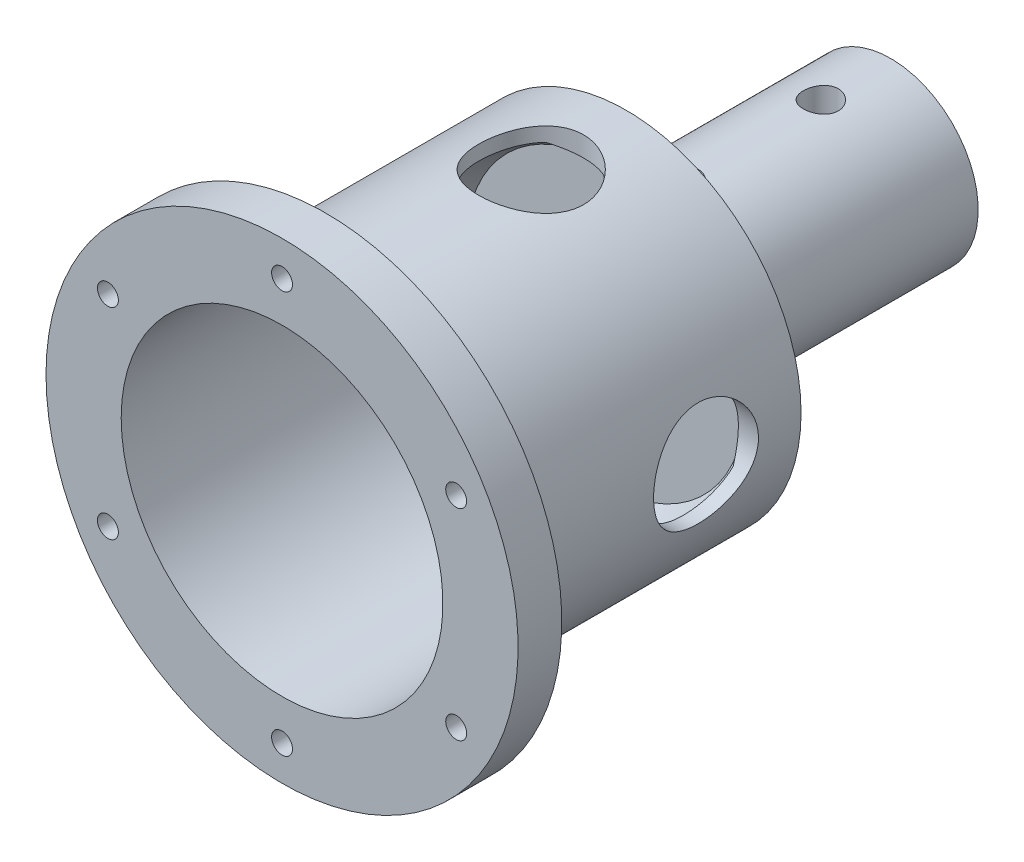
from build123d import *

# Parameters (mm, degrees)
SKETCH2_R                                      = 10.90041
EXTRUDE1_DEPTH                                 = 48.304
CUT_EXTRUDE1_DEPTH                             = 127.064082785
CUT_EXTRUDE1_DEPTH_BACK                        = 127.064082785
SKETCH3_R                                      = 9.525
EXTRUDE2_DEPTH                                 = 127.064082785
EXTRUDE2_DEPTH_BACK                            = 127.064082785
SKETCH4_R                                      = 9.525
CBORE_FOR_6_SOCKET_HEAD_CAP_SCREW1_D           = 3.7973
CBORE_FOR_6_SOCKET_HEAD_CAP_SCREW1_CBORE_D     = 7.14502
CBORE_FOR_6_SOCKET_HEAD_CAP_SCREW1_CBORE_DEPTH = 3.5052
SKETCH7_W                                      = 1.1
SKETCH7_H                                      = 0.59959
CUT_EXTRUDE2_DEPTH                             = 127.064082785
CUT_EXTRUDE2_DEPTH_BACK                        = 127.064082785
SKETCH8_R                                      = 3.175
FILLET1_R                                      = 4.5875


with BuildPart() as part:
    # Sketch1 → Revolve1 (revolve)
    with BuildSketch(Plane(origin=(0, 0, 0), x_dir=(0, 0, -1), z_dir=(1, 0, 0)), mode=Mode.PRIVATE) as revolve1_sk:
        Polygon((0, 29.21), (53.175, 29.21), (58.7375, 25.315095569), (58.7375, 8.73125), (110.534, 8.73125), (110.534, 15.875), (62.5, 15.875), (62.5, 31.75), (7.9375, 31.75), (7.9375, 42.8625), (0, 42.8625), align=None)
    revolve(revolve1_sk.sketch.rotate(Axis((0, 0, 0), (0, 0, 1)), 90), axis=Axis((0, 0, 0), (0, 0, 1)))

    # Sketch2 → Extrude1 (cut)
    with BuildSketch(Plane(origin=(0, 0, -110.534), x_dir=(-1, 0, 0), z_dir=(0, 0, -1))):
        Circle(SKETCH2_R)
    extrude(amount=-EXTRUDE1_DEPTH, mode=Mode.SUBTRACT)

    # Sketch3 → Cut-Extrude1 (cut, two sides: drawn at the far end of the back side and taken through both)
    with BuildSketch(Plane(origin=(0, 0, 0), x_dir=(0, 0, -1), z_dir=(1, 0, 0)).offset(-CUT_EXTRUDE1_DEPTH_BACK)):
        with Locations((45.24375, 0)):
            Circle(SKETCH3_R)
    extrude(amount=CUT_EXTRUDE1_DEPTH + CUT_EXTRUDE1_DEPTH_BACK, mode=Mode.SUBTRACT)

    # Sketch4 → Extrude2 (cut, two sides: drawn at the far end of the back side and taken through both)
    with BuildSketch(Plane(origin=(0, 0, 0), x_dir=(1, 0, 0), z_dir=(0, 1, 0)).offset(-EXTRUDE2_DEPTH_BACK)):
        with Locations(Location((0, 45.24375, 0), (0, 0, 270))):
            Circle(SKETCH4_R)
    extrude(amount=EXTRUDE2_DEPTH + EXTRUDE2_DEPTH_BACK, mode=Mode.SUBTRACT)

    # CBORE for _6 Socket Head Cap Screw1 (through all)
    with Locations(Plane(origin=(0, 0, -7.9375), x_dir=(-1, 0, 0), z_dir=(0, 0, -1))):
        with Locations((0, 36.5125), (31.620752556, 18.25625), (31.620752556, -18.25625), (0, -36.5125), (-31.620752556, -18.25625), (-31.620752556, 18.25625)):
            CounterBoreHole(CBORE_FOR_6_SOCKET_HEAD_CAP_SCREW1_D / 2, CBORE_FOR_6_SOCKET_HEAD_CAP_SCREW1_CBORE_D / 2, CBORE_FOR_6_SOCKET_HEAD_CAP_SCREW1_CBORE_DEPTH)

    # Sketch7 → Cut-Revolve1 (revolve, cut)
    with BuildSketch(Plane(origin=(0, 0, 0), x_dir=(0, 0, -1), z_dir=(1, 0, 0)), mode=Mode.PRIVATE) as cut_revolve1_sk:
        with Locations((108.7726, 11.200205)):
            Rectangle(SKETCH7_W, SKETCH7_H)
    revolve(cut_revolve1_sk.sketch.rotate(Axis((0, 0, 0), (0, 0, 1)), 90), axis=Axis((0, 0, 0), (0, 0, 1)), mode=Mode.SUBTRACT)

    # Sketch8 → Cut-Extrude2 (cut, two sides: drawn at the far end of the back side and taken through both)
    with BuildSketch(Plane(origin=(0, 0, 0), x_dir=(1, 0, 0), z_dir=(0, 1, 0)).offset(-CUT_EXTRUDE2_DEPTH_BACK)):
        with Locations(Location((0, 97.834, 0), (0, 0, 270))):
            Circle(SKETCH8_R)
        with Locations(Location((0, 72.434, 0), (0, 0, 270))):
            Circle(SKETCH8_R)
    extrude(amount=CUT_EXTRUDE2_DEPTH + CUT_EXTRUDE2_DEPTH_BACK, mode=Mode.SUBTRACT)

    # Fillet1
    fillet1_edges = [part.edges().sort_by_distance(p)[0] for p in [
        (15.875, 0, -62.5),
    ]]
    fillet(fillet1_edges, radius=FILLET1_R)


solid = part.part
